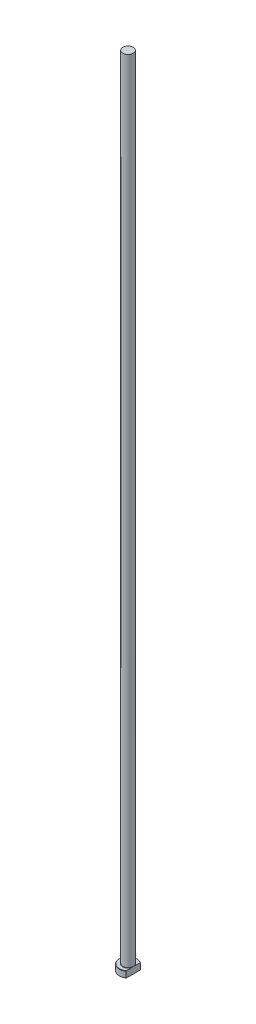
from build123d import *
from build123d.topology import SkipClean

# Parameters (mm, degrees)
CHAMFER1_SIZE = 0.2
FILLET1_R     = 0.2
KEY_DEPTH     = 631.077772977


with BuildPart() as part:
    # Sketch1 → Revolve1 (revolve)
    with BuildSketch(Plane.XY, mode=Mode.PRIVATE) as revolve1_sk:
        Polygon((0, 0), (-7, 0), (-7, 5), (-4.1, 5), (-4.1, 630), (0, 630), align=None)
    revolve(revolve1_sk.sketch.rotate(Axis((0, 259.958771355, 0), (0, -1, 0)), 270), axis=Axis((0, 259.958771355, 0), (0, -1, 0)))

    # Chamfer1
    chamfer1_edges = [part.edges().sort_by_distance(p)[0] for p in [
        (0, 5, -7),
        (0, 0, -7),
    ]]
    chamfer(chamfer1_edges, length=CHAMFER1_SIZE)

    # Fillet1
    fillet1_edges = [part.edges().sort_by_distance(p)[0] for p in [
        (0, 5, -4.1),
    ]]
    fillet(fillet1_edges, radius=FILLET1_R)

    # Sketch2 → KEY (cut, through all)
    with SkipClean():  # the faces are left unmerged after this step: merging them gives an invalid solid
        with BuildSketch(Plane(origin=(0, 0, 0), x_dir=(1, 0, 0), z_dir=(0, 1, 0))):
            with BuildLine():
                Line((4.1, 5.673623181), (4.1, -5.673623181))
                ThreePointArc((4.1, -5.673623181), (7, 0), (4.1, 5.673623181))
            make_face()
        extrude(amount=KEY_DEPTH, mode=Mode.SUBTRACT)


solid = part.part
